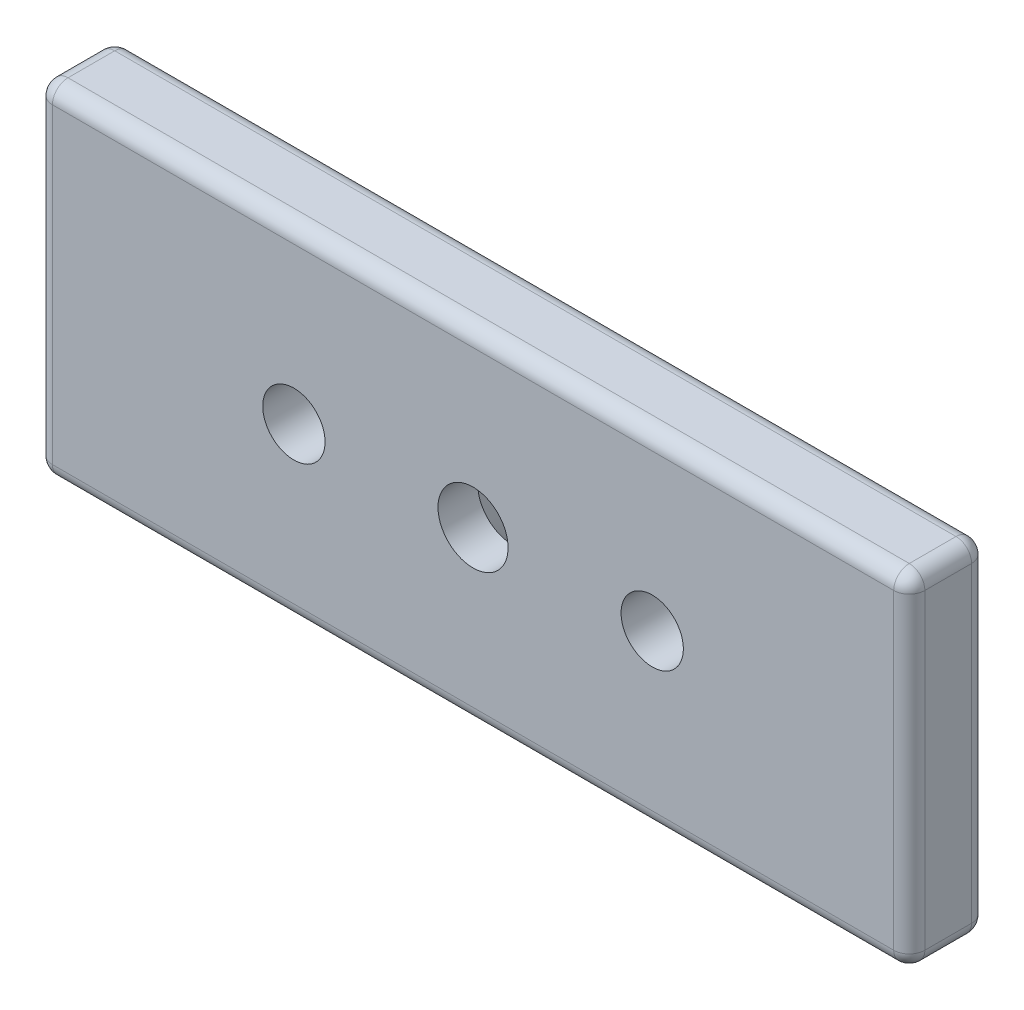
ISO-10303-21;
HEADER;
FILE_DESCRIPTION(('STEP AP214'),'2;1');
FILE_NAME('part.step','',(''),(''),'','','');
FILE_SCHEMA(('AUTOMOTIVE_DESIGN { 1 0 10303 214 1 1 1 1 }'));
ENDSEC;
DATA;
#1=APPLICATION_CONTEXT('core data for automotive mechanical design processes');
#2=APPLICATION_PROTOCOL_DEFINITION('international standard','automotive_design',2000,#1);
#3=PRODUCT_CONTEXT('',#1,'mechanical');
#4=PRODUCT('Part','Part','',(#3));
#5=PRODUCT_RELATED_PRODUCT_CATEGORY('part','',(#4));
#6=PRODUCT_DEFINITION_FORMATION('','',#4);
#7=PRODUCT_DEFINITION_CONTEXT('part definition',#1,'design');
#8=PRODUCT_DEFINITION('design','',#6,#7);
#9=PRODUCT_DEFINITION_SHAPE('','',#8);
#10=(LENGTH_UNIT() NAMED_UNIT(*) SI_UNIT(.MILLI.,.METRE.));
#11=(NAMED_UNIT(*) PLANE_ANGLE_UNIT() SI_UNIT($,.RADIAN.));
#12=(NAMED_UNIT(*) SI_UNIT($,.STERADIAN.) SOLID_ANGLE_UNIT());
#13=UNCERTAINTY_MEASURE_WITH_UNIT(LENGTH_MEASURE(1.E-05),#10,'distance_accuracy_value','');
#14=(GEOMETRIC_REPRESENTATION_CONTEXT(3) GLOBAL_UNCERTAINTY_ASSIGNED_CONTEXT((#13)) GLOBAL_UNIT_ASSIGNED_CONTEXT((#10,
#11,#12)) REPRESENTATION_CONTEXT('',''));
#15=CARTESIAN_POINT('',(0.,0.,0.));
#16=DIRECTION('',(0.,0.,1.));
#17=DIRECTION('',(1.,0.,0.));
#18=AXIS2_PLACEMENT_3D('',#15,#16,#17);
#19=CARTESIAN_POINT('',(0.,0.,-5.));
#20=DIRECTION('',(-1.,0.,0.));
#21=DIRECTION('',(0.,0.,1.));
#22=AXIS2_PLACEMENT_3D('',#19,#20,#21);
#23=PLANE('',#22);
#24=DIRECTION('',(0.,0.,1.));
#25=VECTOR('',#24,1.);
#26=CARTESIAN_POINT('',(0.,21.,-5.));
#27=LINE('',#26,#25);
#28=CARTESIAN_POINT('',(0.,21.,-1.));
#29=VERTEX_POINT('',#28);
#30=CARTESIAN_POINT('',(0.,21.,-4.));
#31=VERTEX_POINT('',#30);
#32=EDGE_CURVE('E158',#29,#31,#27,.F.);
#33=ORIENTED_EDGE('',*,*,#32,.T.);
#34=DIRECTION('',(0.,-1.,0.));
#35=VECTOR('',#34,1.);
#36=CARTESIAN_POINT('',(0.,0.,-4.));
#37=LINE('',#36,#35);
#38=CARTESIAN_POINT('',(0.,1.,-4.));
#39=VERTEX_POINT('',#38);
#40=EDGE_CURVE('E279',#31,#39,#37,.T.);
#41=ORIENTED_EDGE('',*,*,#40,.T.);
#42=DIRECTION('',(0.,0.,1.));
#43=VECTOR('',#42,1.);
#44=CARTESIAN_POINT('',(0.,1.,-5.));
#45=LINE('',#44,#43);
#46=CARTESIAN_POINT('',(0.,1.,-1.));
#47=VERTEX_POINT('',#46);
#48=EDGE_CURVE('E150',#39,#47,#45,.T.);
#49=ORIENTED_EDGE('',*,*,#48,.T.);
#50=DIRECTION('',(0.,-1.,0.));
#51=VECTOR('',#50,1.);
#52=CARTESIAN_POINT('',(0.,21.,-1.));
#53=LINE('',#52,#51);
#54=EDGE_CURVE('E277',#47,#29,#53,.F.);
#55=ORIENTED_EDGE('',*,*,#54,.T.);
#56=EDGE_LOOP('',(#33,#41,#49,#55));
#57=FACE_BOUND('',#56,.T.);
#58=ADVANCED_FACE('F38',(#57),#23,.T.);
#59=CARTESIAN_POINT('',(0.,22.,-5.));
#60=DIRECTION('',(0.,1.,0.));
#61=DIRECTION('',(0.,0.,1.));
#62=AXIS2_PLACEMENT_3D('',#59,#60,#61);
#63=PLANE('',#62);
#64=DIRECTION('',(0.,0.,1.));
#65=VECTOR('',#64,1.);
#66=CARTESIAN_POINT('',(55.,22.,-5.));
#67=LINE('',#66,#65);
#68=CARTESIAN_POINT('',(55.,22.,-1.));
#69=VERTEX_POINT('',#68);
#70=CARTESIAN_POINT('',(55.,22.,-4.));
#71=VERTEX_POINT('',#70);
#72=EDGE_CURVE('E131',#69,#71,#67,.F.);
#73=ORIENTED_EDGE('',*,*,#72,.T.);
#74=DIRECTION('',(-1.,0.,0.));
#75=VECTOR('',#74,1.);
#76=CARTESIAN_POINT('',(0.,22.,-4.));
#77=LINE('',#76,#75);
#78=CARTESIAN_POINT('',(1.,22.,-4.));
#79=VERTEX_POINT('',#78);
#80=EDGE_CURVE('E11',#71,#79,#77,.T.);
#81=ORIENTED_EDGE('',*,*,#80,.T.);
#82=DIRECTION('',(0.,0.,1.));
#83=VECTOR('',#82,1.);
#84=CARTESIAN_POINT('',(1.,22.,-5.));
#85=LINE('',#84,#83);
#86=CARTESIAN_POINT('',(1.,22.,-1.));
#87=VERTEX_POINT('',#86);
#88=EDGE_CURVE('E133',#79,#87,#85,.T.);
#89=ORIENTED_EDGE('',*,*,#88,.T.);
#90=DIRECTION('',(-1.,0.,0.));
#91=VECTOR('',#90,1.);
#92=CARTESIAN_POINT('',(55.,22.,-1.));
#93=LINE('',#92,#91);
#94=EDGE_CURVE('E47',#87,#69,#93,.F.);
#95=ORIENTED_EDGE('',*,*,#94,.T.);
#96=EDGE_LOOP('',(#73,#81,#89,#95));
#97=FACE_BOUND('',#96,.T.);
#98=ADVANCED_FACE('F130',(#97),#63,.T.);
#99=CARTESIAN_POINT('',(56.,0.,-5.));
#100=DIRECTION('',(1.,0.,0.));
#101=DIRECTION('',(0.,0.,-1.));
#102=AXIS2_PLACEMENT_3D('',#99,#100,#101);
#103=PLANE('',#102);
#104=DIRECTION('',(0.,0.,1.));
#105=VECTOR('',#104,1.);
#106=CARTESIAN_POINT('',(56.,1.,-5.));
#107=LINE('',#106,#105);
#108=CARTESIAN_POINT('',(56.,1.,-1.));
#109=VERTEX_POINT('',#108);
#110=CARTESIAN_POINT('',(56.,1.,-4.));
#111=VERTEX_POINT('',#110);
#112=EDGE_CURVE('E243',#109,#111,#107,.F.);
#113=ORIENTED_EDGE('',*,*,#112,.T.);
#114=DIRECTION('',(0.,1.,0.));
#115=VECTOR('',#114,1.);
#116=CARTESIAN_POINT('',(56.,0.,-4.));
#117=LINE('',#116,#115);
#118=CARTESIAN_POINT('',(56.,21.,-4.));
#119=VERTEX_POINT('',#118);
#120=EDGE_CURVE('E254',#111,#119,#117,.T.);
#121=ORIENTED_EDGE('',*,*,#120,.T.);
#122=DIRECTION('',(0.,0.,1.));
#123=VECTOR('',#122,1.);
#124=CARTESIAN_POINT('',(56.,21.,-5.));
#125=LINE('',#124,#123);
#126=CARTESIAN_POINT('',(56.,21.,-1.));
#127=VERTEX_POINT('',#126);
#128=EDGE_CURVE('E241',#119,#127,#125,.T.);
#129=ORIENTED_EDGE('',*,*,#128,.T.);
#130=DIRECTION('',(0.,1.,0.));
#131=VECTOR('',#130,1.);
#132=CARTESIAN_POINT('',(56.,1.,-1.));
#133=LINE('',#132,#131);
#134=EDGE_CURVE('E252',#127,#109,#133,.F.);
#135=ORIENTED_EDGE('',*,*,#134,.T.);
#136=EDGE_LOOP('',(#113,#121,#129,#135));
#137=FACE_BOUND('',#136,.T.);
#138=ADVANCED_FACE('F296',(#137),#103,.T.);
#139=CARTESIAN_POINT('',(0.,0.,-5.));
#140=DIRECTION('',(0.,-1.,0.));
#141=DIRECTION('',(0.,0.,-1.));
#142=AXIS2_PLACEMENT_3D('',#139,#140,#141);
#143=PLANE('',#142);
#144=DIRECTION('',(0.,0.,1.));
#145=VECTOR('',#144,1.);
#146=CARTESIAN_POINT('',(1.,0.,-5.));
#147=LINE('',#146,#145);
#148=CARTESIAN_POINT('',(1.,0.,-1.));
#149=VERTEX_POINT('',#148);
#150=CARTESIAN_POINT('',(1.,0.,-4.));
#151=VERTEX_POINT('',#150);
#152=EDGE_CURVE('E233',#149,#151,#147,.F.);
#153=ORIENTED_EDGE('',*,*,#152,.T.);
#154=DIRECTION('',(1.,0.,0.));
#155=VECTOR('',#154,1.);
#156=CARTESIAN_POINT('',(0.,0.,-4.));
#157=LINE('',#156,#155);
#158=CARTESIAN_POINT('',(55.,0.,-4.));
#159=VERTEX_POINT('',#158);
#160=EDGE_CURVE('E271',#151,#159,#157,.T.);
#161=ORIENTED_EDGE('',*,*,#160,.T.);
#162=DIRECTION('',(0.,0.,1.));
#163=VECTOR('',#162,1.);
#164=CARTESIAN_POINT('',(55.,0.,-5.));
#165=LINE('',#164,#163);
#166=CARTESIAN_POINT('',(55.,0.,-1.));
#167=VERTEX_POINT('',#166);
#168=EDGE_CURVE('E238',#159,#167,#165,.T.);
#169=ORIENTED_EDGE('',*,*,#168,.T.);
#170=DIRECTION('',(1.,0.,0.));
#171=VECTOR('',#170,1.);
#172=CARTESIAN_POINT('',(1.,0.,-1.));
#173=LINE('',#172,#171);
#174=EDGE_CURVE('E269',#167,#149,#173,.F.);
#175=ORIENTED_EDGE('',*,*,#174,.T.);
#176=EDGE_LOOP('',(#153,#161,#169,#175));
#177=FACE_BOUND('',#176,.T.);
#178=ADVANCED_FACE('F308',(#177),#143,.T.);
#179=CARTESIAN_POINT('',(0.,22.,-5.));
#180=DIRECTION('',(0.,0.,-1.));
#181=DIRECTION('',(-1.,0.,0.));
#182=AXIS2_PLACEMENT_3D('',#179,#180,#181);
#183=PLANE('',#182);
#184=CARTESIAN_POINT('',(28.,11.,-5.));
#185=DIRECTION('',(0.,0.,-1.));
#186=DIRECTION('',(-1.,0.,0.));
#187=AXIS2_PLACEMENT_3D('',#184,#185,#186);
#188=CIRCLE('',#187,4.7);
#189=CARTESIAN_POINT('',(23.3,11.,-5.));
#190=VERTEX_POINT('',#189);
#191=EDGE_CURVE('E615',#190,#190,#188,.T.);
#192=ORIENTED_EDGE('',*,*,#191,.F.);
#193=EDGE_LOOP('',(#192));
#194=FACE_BOUND('',#193,.T.);
#195=DIRECTION('',(-1.,0.,0.));
#196=VECTOR('',#195,1.);
#197=CARTESIAN_POINT('',(0.,21.,-5.));
#198=LINE('',#197,#196);
#199=CARTESIAN_POINT('',(1.,21.,-5.));
#200=VERTEX_POINT('',#199);
#201=CARTESIAN_POINT('',(55.,21.,-5.));
#202=VERTEX_POINT('',#201);
#203=EDGE_CURVE('E256',#200,#202,#198,.F.);
#204=ORIENTED_EDGE('',*,*,#203,.T.);
#205=DIRECTION('',(0.,1.,0.));
#206=VECTOR('',#205,1.);
#207=CARTESIAN_POINT('',(55.,22.,-5.));
#208=LINE('',#207,#206);
#209=CARTESIAN_POINT('',(55.,1.,-5.));
#210=VERTEX_POINT('',#209);
#211=EDGE_CURVE('E262',#202,#210,#208,.F.);
#212=ORIENTED_EDGE('',*,*,#211,.T.);
#213=DIRECTION('',(1.,0.,0.));
#214=VECTOR('',#213,1.);
#215=CARTESIAN_POINT('',(0.,1.,-5.));
#216=LINE('',#215,#214);
#217=CARTESIAN_POINT('',(1.,1.,-5.));
#218=VERTEX_POINT('',#217);
#219=EDGE_CURVE('E260',#210,#218,#216,.F.);
#220=ORIENTED_EDGE('',*,*,#219,.T.);
#221=DIRECTION('',(0.,-1.,0.));
#222=VECTOR('',#221,1.);
#223=CARTESIAN_POINT('',(1.,22.,-5.));
#224=LINE('',#223,#222);
#225=EDGE_CURVE('E258',#218,#200,#224,.F.);
#226=ORIENTED_EDGE('',*,*,#225,.T.);
#227=EDGE_LOOP('',(#204,#212,#220,#226));
#228=FACE_BOUND('',#227,.T.);
#229=CARTESIAN_POINT('',(39.5,11.,-5.));
#230=DIRECTION('',(0.,0.,1.));
#231=DIRECTION('',(1.,0.,0.));
#232=AXIS2_PLACEMENT_3D('',#229,#230,#231);
#233=CIRCLE('',#232,2.);
#234=CARTESIAN_POINT('',(41.5,11.,-5.));
#235=VERTEX_POINT('',#234);
#236=EDGE_CURVE('E222',#235,#235,#233,.T.);
#237=ORIENTED_EDGE('',*,*,#236,.T.);
#238=EDGE_LOOP('',(#237));
#239=FACE_BOUND('',#238,.T.);
#240=CARTESIAN_POINT('',(16.5,11.,-5.));
#241=DIRECTION('',(0.,0.,1.));
#242=DIRECTION('',(1.,0.,0.));
#243=AXIS2_PLACEMENT_3D('',#240,#241,#242);
#244=CIRCLE('',#243,2.);
#245=CARTESIAN_POINT('',(18.5,11.,-5.));
#246=VERTEX_POINT('',#245);
#247=EDGE_CURVE('E230',#246,#246,#244,.T.);
#248=ORIENTED_EDGE('',*,*,#247,.T.);
#249=EDGE_LOOP('',(#248));
#250=FACE_BOUND('',#249,.T.);
#251=ADVANCED_FACE('F334',(#194,#228,#239,#250),#183,.T.);
#252=CARTESIAN_POINT('',(0.,22.,0.));
#253=DIRECTION('',(0.,0.,-1.));
#254=DIRECTION('',(-1.,0.,0.));
#255=AXIS2_PLACEMENT_3D('',#252,#253,#254);
#256=PLANE('',#255);
#257=CARTESIAN_POINT('',(28.,11.,0.));
#258=DIRECTION('',(0.,0.,-1.));
#259=DIRECTION('',(-1.,0.,0.));
#260=AXIS2_PLACEMENT_3D('',#257,#258,#259);
#261=CIRCLE('',#260,2.25);
#262=CARTESIAN_POINT('',(25.75,11.,0.));
#263=VERTEX_POINT('',#262);
#264=EDGE_CURVE('E163',#263,#263,#261,.T.);
#265=ORIENTED_EDGE('',*,*,#264,.T.);
#266=EDGE_LOOP('',(#265));
#267=FACE_BOUND('',#266,.T.);
#268=DIRECTION('',(1.,0.,0.));
#269=VECTOR('',#268,1.);
#270=CARTESIAN_POINT('',(55.,1.,0.));
#271=LINE('',#270,#269);
#272=CARTESIAN_POINT('',(1.,1.,0.));
#273=VERTEX_POINT('',#272);
#274=CARTESIAN_POINT('',(55.,1.,0.));
#275=VERTEX_POINT('',#274);
#276=EDGE_CURVE('E55',#273,#275,#271,.T.);
#277=ORIENTED_EDGE('',*,*,#276,.T.);
#278=DIRECTION('',(0.,1.,0.));
#279=VECTOR('',#278,1.);
#280=CARTESIAN_POINT('',(55.,21.,0.));
#281=LINE('',#280,#279);
#282=CARTESIAN_POINT('',(55.,21.,0.));
#283=VERTEX_POINT('',#282);
#284=EDGE_CURVE('E138',#275,#283,#281,.T.);
#285=ORIENTED_EDGE('',*,*,#284,.T.);
#286=DIRECTION('',(-1.,0.,0.));
#287=VECTOR('',#286,1.);
#288=CARTESIAN_POINT('',(1.,21.,0.));
#289=LINE('',#288,#287);
#290=CARTESIAN_POINT('',(1.,21.,0.));
#291=VERTEX_POINT('',#290);
#292=EDGE_CURVE('E162',#283,#291,#289,.T.);
#293=ORIENTED_EDGE('',*,*,#292,.T.);
#294=DIRECTION('',(0.,-1.,0.));
#295=VECTOR('',#294,1.);
#296=CARTESIAN_POINT('',(1.,1.,0.));
#297=LINE('',#296,#295);
#298=EDGE_CURVE('E60',#291,#273,#297,.T.);
#299=ORIENTED_EDGE('',*,*,#298,.T.);
#300=EDGE_LOOP('',(#277,#285,#293,#299));
#301=FACE_BOUND('',#300,.T.);
#302=CARTESIAN_POINT('',(39.5,11.,0.));
#303=DIRECTION('',(0.,0.,1.));
#304=DIRECTION('',(1.,0.,0.));
#305=AXIS2_PLACEMENT_3D('',#302,#303,#304);
#306=CIRCLE('',#305,2.);
#307=CARTESIAN_POINT('',(41.5,11.,0.));
#308=VERTEX_POINT('',#307);
#309=EDGE_CURVE('E217',#308,#308,#306,.T.);
#310=ORIENTED_EDGE('',*,*,#309,.F.);
#311=EDGE_LOOP('',(#310));
#312=FACE_BOUND('',#311,.T.);
#313=CARTESIAN_POINT('',(16.5,11.,0.));
#314=DIRECTION('',(0.,0.,1.));
#315=DIRECTION('',(1.,0.,0.));
#316=AXIS2_PLACEMENT_3D('',#313,#314,#315);
#317=CIRCLE('',#316,2.);
#318=CARTESIAN_POINT('',(18.5,11.,0.));
#319=VERTEX_POINT('',#318);
#320=EDGE_CURVE('E227',#319,#319,#317,.T.);
#321=ORIENTED_EDGE('',*,*,#320,.F.);
#322=EDGE_LOOP('',(#321));
#323=FACE_BOUND('',#322,.T.);
#324=ADVANCED_FACE('F289',(#267,#301,#312,#323),#256,.F.);
#325=CARTESIAN_POINT('',(16.5,11.,-5.));
#326=DIRECTION('',(0.,0.,1.));
#327=DIRECTION('',(1.,0.,0.));
#328=AXIS2_PLACEMENT_3D('',#325,#326,#327);
#329=CYLINDRICAL_SURFACE('',#328,2.);
#330=ORIENTED_EDGE('',*,*,#247,.F.);
#331=EDGE_LOOP('',(#330));
#332=FACE_BOUND('',#331,.T.);
#333=ORIENTED_EDGE('',*,*,#320,.T.);
#334=EDGE_LOOP('',(#333));
#335=FACE_BOUND('',#334,.T.);
#336=ADVANCED_FACE('F555',(#332,#335),#329,.F.);
#337=CARTESIAN_POINT('',(39.5,11.,-5.));
#338=DIRECTION('',(0.,0.,1.));
#339=DIRECTION('',(1.,0.,0.));
#340=AXIS2_PLACEMENT_3D('',#337,#338,#339);
#341=CYLINDRICAL_SURFACE('',#340,2.);
#342=ORIENTED_EDGE('',*,*,#236,.F.);
#343=EDGE_LOOP('',(#342));
#344=FACE_BOUND('',#343,.T.);
#345=ORIENTED_EDGE('',*,*,#309,.T.);
#346=EDGE_LOOP('',(#345));
#347=FACE_BOUND('',#346,.T.);
#348=ADVANCED_FACE('F364',(#344,#347),#341,.F.);
#349=CARTESIAN_POINT('',(55.,1.,-5.));
#350=DIRECTION('',(0.,0.,1.));
#351=DIRECTION('',(1.,0.,0.));
#352=AXIS2_PLACEMENT_3D('',#349,#350,#351);
#353=CYLINDRICAL_SURFACE('',#352,1.);
#354=ORIENTED_EDGE('',*,*,#168,.F.);
#355=CARTESIAN_POINT('',(55.,1.,-4.));
#356=DIRECTION('',(0.,0.,1.));
#357=DIRECTION('',(1.,0.,0.));
#358=AXIS2_PLACEMENT_3D('',#355,#356,#357);
#359=CIRCLE('',#358,1.);
#360=EDGE_CURVE('E267',#159,#111,#359,.T.);
#361=ORIENTED_EDGE('',*,*,#360,.T.);
#362=ORIENTED_EDGE('',*,*,#112,.F.);
#363=CARTESIAN_POINT('',(55.,1.,-1.));
#364=DIRECTION('',(0.,0.,1.));
#365=DIRECTION('',(1.,0.,0.));
#366=AXIS2_PLACEMENT_3D('',#363,#364,#365);
#367=CIRCLE('',#366,1.);
#368=EDGE_CURVE('E265',#109,#167,#367,.F.);
#369=ORIENTED_EDGE('',*,*,#368,.T.);
#370=EDGE_LOOP('',(#354,#361,#362,#369));
#371=FACE_BOUND('',#370,.T.);
#372=ADVANCED_FACE('F301',(#371),#353,.T.);
#373=CARTESIAN_POINT('',(55.,21.,-5.));
#374=DIRECTION('',(0.,0.,1.));
#375=DIRECTION('',(1.,0.,0.));
#376=AXIS2_PLACEMENT_3D('',#373,#374,#375);
#377=CYLINDRICAL_SURFACE('',#376,1.);
#378=ORIENTED_EDGE('',*,*,#128,.F.);
#379=CARTESIAN_POINT('',(55.,21.,-4.));
#380=DIRECTION('',(0.,0.,1.));
#381=DIRECTION('',(1.,0.,0.));
#382=AXIS2_PLACEMENT_3D('',#379,#380,#381);
#383=CIRCLE('',#382,1.);
#384=EDGE_CURVE('E149',#119,#71,#383,.T.);
#385=ORIENTED_EDGE('',*,*,#384,.T.);
#386=ORIENTED_EDGE('',*,*,#72,.F.);
#387=CARTESIAN_POINT('',(55.,21.,-1.));
#388=DIRECTION('',(0.,0.,1.));
#389=DIRECTION('',(1.,0.,0.));
#390=AXIS2_PLACEMENT_3D('',#387,#388,#389);
#391=CIRCLE('',#390,1.);
#392=EDGE_CURVE('E146',#69,#127,#391,.F.);
#393=ORIENTED_EDGE('',*,*,#392,.T.);
#394=EDGE_LOOP('',(#378,#385,#386,#393));
#395=FACE_BOUND('',#394,.T.);
#396=ADVANCED_FACE('F145',(#395),#377,.T.);
#397=CARTESIAN_POINT('',(1.,21.,-5.));
#398=DIRECTION('',(0.,0.,1.));
#399=DIRECTION('',(1.,0.,0.));
#400=AXIS2_PLACEMENT_3D('',#397,#398,#399);
#401=CYLINDRICAL_SURFACE('',#400,1.);
#402=ORIENTED_EDGE('',*,*,#88,.F.);
#403=CARTESIAN_POINT('',(1.,21.,-4.));
#404=DIRECTION('',(0.,0.,1.));
#405=DIRECTION('',(1.,0.,0.));
#406=AXIS2_PLACEMENT_3D('',#403,#404,#405);
#407=CIRCLE('',#406,1.);
#408=EDGE_CURVE('E283',#79,#31,#407,.T.);
#409=ORIENTED_EDGE('',*,*,#408,.T.);
#410=ORIENTED_EDGE('',*,*,#32,.F.);
#411=CARTESIAN_POINT('',(1.,21.,-1.));
#412=DIRECTION('',(0.,0.,1.));
#413=DIRECTION('',(1.,0.,0.));
#414=AXIS2_PLACEMENT_3D('',#411,#412,#413);
#415=CIRCLE('',#414,1.);
#416=EDGE_CURVE('E281',#29,#87,#415,.F.);
#417=ORIENTED_EDGE('',*,*,#416,.T.);
#418=EDGE_LOOP('',(#402,#409,#410,#417));
#419=FACE_BOUND('',#418,.T.);
#420=ADVANCED_FACE('F321',(#419),#401,.T.);
#421=CARTESIAN_POINT('',(1.,1.,-5.));
#422=DIRECTION('',(0.,0.,1.));
#423=DIRECTION('',(1.,0.,0.));
#424=AXIS2_PLACEMENT_3D('',#421,#422,#423);
#425=CYLINDRICAL_SURFACE('',#424,1.);
#426=ORIENTED_EDGE('',*,*,#48,.F.);
#427=CARTESIAN_POINT('',(1.,1.,-4.));
#428=DIRECTION('',(0.,0.,1.));
#429=DIRECTION('',(1.,0.,0.));
#430=AXIS2_PLACEMENT_3D('',#427,#428,#429);
#431=CIRCLE('',#430,1.);
#432=EDGE_CURVE('E275',#39,#151,#431,.T.);
#433=ORIENTED_EDGE('',*,*,#432,.T.);
#434=ORIENTED_EDGE('',*,*,#152,.F.);
#435=CARTESIAN_POINT('',(1.,1.,-1.));
#436=DIRECTION('',(0.,0.,1.));
#437=DIRECTION('',(1.,0.,0.));
#438=AXIS2_PLACEMENT_3D('',#435,#436,#437);
#439=CIRCLE('',#438,1.);
#440=EDGE_CURVE('E273',#149,#47,#439,.F.);
#441=ORIENTED_EDGE('',*,*,#440,.T.);
#442=EDGE_LOOP('',(#426,#433,#434,#441));
#443=FACE_BOUND('',#442,.T.);
#444=ADVANCED_FACE('F312',(#443),#425,.T.);
#445=CARTESIAN_POINT('',(1.,1.,-4.));
#446=DIRECTION('',(0.,0.,1.));
#447=DIRECTION('',(1.,0.,0.));
#448=AXIS2_PLACEMENT_3D('',#445,#446,#447);
#449=SPHERICAL_SURFACE('',#448,1.);
#450=CARTESIAN_POINT('',(1.,1.,-4.));
#451=DIRECTION('',(1.,0.,0.));
#452=DIRECTION('',(0.,0.,-1.));
#453=AXIS2_PLACEMENT_3D('',#450,#451,#452);
#454=CIRCLE('',#453,1.);
#455=EDGE_CURVE('E209',#151,#218,#454,.T.);
#456=ORIENTED_EDGE('',*,*,#455,.F.);
#457=ORIENTED_EDGE('',*,*,#432,.F.);
#458=CARTESIAN_POINT('',(1.,1.,-4.));
#459=DIRECTION('',(0.,1.,0.));
#460=DIRECTION('',(0.,0.,1.));
#461=AXIS2_PLACEMENT_3D('',#458,#459,#460);
#462=CIRCLE('',#461,1.);
#463=EDGE_CURVE('E171',#218,#39,#462,.T.);
#464=ORIENTED_EDGE('',*,*,#463,.F.);
#465=EDGE_LOOP('',(#456,#457,#464));
#466=FACE_BOUND('',#465,.T.);
#467=ADVANCED_FACE('F351',(#466),#449,.T.);
#468=CARTESIAN_POINT('',(1.,0.,-4.));
#469=DIRECTION('',(0.,-1.,0.));
#470=DIRECTION('',(0.,0.,-1.));
#471=AXIS2_PLACEMENT_3D('',#468,#469,#470);
#472=CYLINDRICAL_SURFACE('',#471,1.);
#473=ORIENTED_EDGE('',*,*,#463,.T.);
#474=ORIENTED_EDGE('',*,*,#40,.F.);
#475=CARTESIAN_POINT('',(1.,21.,-4.));
#476=DIRECTION('',(0.,1.,0.));
#477=DIRECTION('',(0.,0.,1.));
#478=AXIS2_PLACEMENT_3D('',#475,#476,#477);
#479=CIRCLE('',#478,1.);
#480=EDGE_CURVE('E207',#200,#31,#479,.T.);
#481=ORIENTED_EDGE('',*,*,#480,.F.);
#482=ORIENTED_EDGE('',*,*,#225,.F.);
#483=EDGE_LOOP('',(#473,#474,#481,#482));
#484=FACE_BOUND('',#483,.T.);
#485=ADVANCED_FACE('F344',(#484),#472,.T.);
#486=CARTESIAN_POINT('',(0.,1.,-4.));
#487=DIRECTION('',(1.,0.,0.));
#488=DIRECTION('',(0.,0.,-1.));
#489=AXIS2_PLACEMENT_3D('',#486,#487,#488);
#490=CYLINDRICAL_SURFACE('',#489,1.);
#491=ORIENTED_EDGE('',*,*,#455,.T.);
#492=ORIENTED_EDGE('',*,*,#219,.F.);
#493=CARTESIAN_POINT('',(55.,1.,-4.));
#494=DIRECTION('',(1.,0.,0.));
#495=DIRECTION('',(0.,0.,-1.));
#496=AXIS2_PLACEMENT_3D('',#493,#494,#495);
#497=CIRCLE('',#496,1.);
#498=EDGE_CURVE('E204',#159,#210,#497,.T.);
#499=ORIENTED_EDGE('',*,*,#498,.F.);
#500=ORIENTED_EDGE('',*,*,#160,.F.);
#501=EDGE_LOOP('',(#491,#492,#499,#500));
#502=FACE_BOUND('',#501,.T.);
#503=ADVANCED_FACE('F342',(#502),#490,.T.);
#504=CARTESIAN_POINT('',(1.,21.,-4.));
#505=DIRECTION('',(0.,0.,1.));
#506=DIRECTION('',(1.,0.,0.));
#507=AXIS2_PLACEMENT_3D('',#504,#505,#506);
#508=SPHERICAL_SURFACE('',#507,1.);
#509=ORIENTED_EDGE('',*,*,#480,.T.);
#510=ORIENTED_EDGE('',*,*,#408,.F.);
#511=CARTESIAN_POINT('',(1.,21.,-4.));
#512=DIRECTION('',(1.,0.,0.));
#513=DIRECTION('',(0.,0.,-1.));
#514=AXIS2_PLACEMENT_3D('',#511,#512,#513);
#515=CIRCLE('',#514,1.);
#516=EDGE_CURVE('E201',#200,#79,#515,.T.);
#517=ORIENTED_EDGE('',*,*,#516,.F.);
#518=EDGE_LOOP('',(#509,#510,#517));
#519=FACE_BOUND('',#518,.T.);
#520=ADVANCED_FACE('F325',(#519),#508,.T.);
#521=CARTESIAN_POINT('',(55.,1.,-4.));
#522=DIRECTION('',(0.,0.,1.));
#523=DIRECTION('',(1.,0.,0.));
#524=AXIS2_PLACEMENT_3D('',#521,#522,#523);
#525=SPHERICAL_SURFACE('',#524,1.);
#526=ORIENTED_EDGE('',*,*,#360,.F.);
#527=ORIENTED_EDGE('',*,*,#498,.T.);
#528=CARTESIAN_POINT('',(55.,1.,-4.));
#529=DIRECTION('',(0.,1.,0.));
#530=DIRECTION('',(0.,0.,1.));
#531=AXIS2_PLACEMENT_3D('',#528,#529,#530);
#532=CIRCLE('',#531,1.);
#533=EDGE_CURVE('E197',#111,#210,#532,.T.);
#534=ORIENTED_EDGE('',*,*,#533,.F.);
#535=EDGE_LOOP('',(#526,#527,#534));
#536=FACE_BOUND('',#535,.T.);
#537=ADVANCED_FACE('F341',(#536),#525,.T.);
#538=CARTESIAN_POINT('',(0.,21.,-4.));
#539=DIRECTION('',(-1.,0.,0.));
#540=DIRECTION('',(0.,0.,1.));
#541=AXIS2_PLACEMENT_3D('',#538,#539,#540);
#542=CYLINDRICAL_SURFACE('',#541,1.);
#543=ORIENTED_EDGE('',*,*,#516,.T.);
#544=ORIENTED_EDGE('',*,*,#80,.F.);
#545=CARTESIAN_POINT('',(55.,21.,-4.));
#546=DIRECTION('',(1.,0.,0.));
#547=DIRECTION('',(0.,0.,-1.));
#548=AXIS2_PLACEMENT_3D('',#545,#546,#547);
#549=CIRCLE('',#548,1.);
#550=EDGE_CURVE('E193',#202,#71,#549,.T.);
#551=ORIENTED_EDGE('',*,*,#550,.F.);
#552=ORIENTED_EDGE('',*,*,#203,.F.);
#553=EDGE_LOOP('',(#543,#544,#551,#552));
#554=FACE_BOUND('',#553,.T.);
#555=ADVANCED_FACE('F330',(#554),#542,.T.);
#556=CARTESIAN_POINT('',(55.,0.,-4.));
#557=DIRECTION('',(0.,1.,0.));
#558=DIRECTION('',(0.,0.,1.));
#559=AXIS2_PLACEMENT_3D('',#556,#557,#558);
#560=CYLINDRICAL_SURFACE('',#559,1.);
#561=ORIENTED_EDGE('',*,*,#533,.T.);
#562=ORIENTED_EDGE('',*,*,#211,.F.);
#563=CARTESIAN_POINT('',(55.,21.,-4.));
#564=DIRECTION('',(0.,1.,0.));
#565=DIRECTION('',(0.,0.,1.));
#566=AXIS2_PLACEMENT_3D('',#563,#564,#565);
#567=CIRCLE('',#566,1.);
#568=EDGE_CURVE('E189',#119,#202,#567,.T.);
#569=ORIENTED_EDGE('',*,*,#568,.F.);
#570=ORIENTED_EDGE('',*,*,#120,.F.);
#571=EDGE_LOOP('',(#561,#562,#569,#570));
#572=FACE_BOUND('',#571,.T.);
#573=ADVANCED_FACE('F337',(#572),#560,.T.);
#574=CARTESIAN_POINT('',(55.,21.,-4.));
#575=DIRECTION('',(0.,0.,1.));
#576=DIRECTION('',(1.,0.,0.));
#577=AXIS2_PLACEMENT_3D('',#574,#575,#576);
#578=SPHERICAL_SURFACE('',#577,1.);
#579=ORIENTED_EDGE('',*,*,#550,.T.);
#580=ORIENTED_EDGE('',*,*,#384,.F.);
#581=ORIENTED_EDGE('',*,*,#568,.T.);
#582=EDGE_LOOP('',(#579,#580,#581));
#583=FACE_BOUND('',#582,.T.);
#584=ADVANCED_FACE('F371',(#583),#578,.T.);
#585=CARTESIAN_POINT('',(1.,1.,-1.));
#586=DIRECTION('',(0.,0.,1.));
#587=DIRECTION('',(1.,0.,0.));
#588=AXIS2_PLACEMENT_3D('',#585,#586,#587);
#589=SPHERICAL_SURFACE('',#588,1.);
#590=CARTESIAN_POINT('',(1.,1.,-1.));
#591=DIRECTION('',(0.,1.,0.));
#592=DIRECTION('',(0.,0.,1.));
#593=AXIS2_PLACEMENT_3D('',#590,#591,#592);
#594=CIRCLE('',#593,1.);
#595=EDGE_CURVE('E183',#47,#273,#594,.T.);
#596=ORIENTED_EDGE('',*,*,#595,.F.);
#597=ORIENTED_EDGE('',*,*,#440,.F.);
#598=CARTESIAN_POINT('',(1.,1.,-1.));
#599=DIRECTION('',(1.,0.,0.));
#600=DIRECTION('',(0.,0.,-1.));
#601=AXIS2_PLACEMENT_3D('',#598,#599,#600);
#602=CIRCLE('',#601,1.);
#603=EDGE_CURVE('E42',#273,#149,#602,.T.);
#604=ORIENTED_EDGE('',*,*,#603,.F.);
#605=EDGE_LOOP('',(#596,#597,#604));
#606=FACE_BOUND('',#605,.T.);
#607=ADVANCED_FACE('F40',(#606),#589,.T.);
#608=CARTESIAN_POINT('',(0.,1.,-1.));
#609=DIRECTION('',(-1.,0.,0.));
#610=DIRECTION('',(0.,0.,1.));
#611=AXIS2_PLACEMENT_3D('',#608,#609,#610);
#612=CYLINDRICAL_SURFACE('',#611,1.);
#613=ORIENTED_EDGE('',*,*,#603,.T.);
#614=ORIENTED_EDGE('',*,*,#174,.F.);
#615=CARTESIAN_POINT('',(55.,1.,-1.));
#616=DIRECTION('',(1.,0.,0.));
#617=DIRECTION('',(0.,0.,-1.));
#618=AXIS2_PLACEMENT_3D('',#615,#616,#617);
#619=CIRCLE('',#618,1.);
#620=EDGE_CURVE('E181',#275,#167,#619,.T.);
#621=ORIENTED_EDGE('',*,*,#620,.F.);
#622=ORIENTED_EDGE('',*,*,#276,.F.);
#623=EDGE_LOOP('',(#613,#614,#621,#622));
#624=FACE_BOUND('',#623,.T.);
#625=ADVANCED_FACE('F305',(#624),#612,.T.);
#626=CARTESIAN_POINT('',(1.,22.,-1.));
#627=DIRECTION('',(0.,1.,0.));
#628=DIRECTION('',(0.,0.,1.));
#629=AXIS2_PLACEMENT_3D('',#626,#627,#628);
#630=CYLINDRICAL_SURFACE('',#629,1.);
#631=ORIENTED_EDGE('',*,*,#595,.T.);
#632=ORIENTED_EDGE('',*,*,#298,.F.);
#633=CARTESIAN_POINT('',(1.,21.,-1.));
#634=DIRECTION('',(0.,1.,0.));
#635=DIRECTION('',(0.,0.,1.));
#636=AXIS2_PLACEMENT_3D('',#633,#634,#635);
#637=CIRCLE('',#636,1.);
#638=EDGE_CURVE('E178',#29,#291,#637,.T.);
#639=ORIENTED_EDGE('',*,*,#638,.F.);
#640=ORIENTED_EDGE('',*,*,#54,.F.);
#641=EDGE_LOOP('',(#631,#632,#639,#640));
#642=FACE_BOUND('',#641,.T.);
#643=ADVANCED_FACE('F316',(#642),#630,.T.);
#644=CARTESIAN_POINT('',(55.,1.,-1.));
#645=DIRECTION('',(0.,0.,1.));
#646=DIRECTION('',(1.,0.,0.));
#647=AXIS2_PLACEMENT_3D('',#644,#645,#646);
#648=SPHERICAL_SURFACE('',#647,1.);
#649=ORIENTED_EDGE('',*,*,#620,.T.);
#650=ORIENTED_EDGE('',*,*,#368,.F.);
#651=CARTESIAN_POINT('',(55.,1.,-1.));
#652=DIRECTION('',(0.,1.,0.));
#653=DIRECTION('',(0.,0.,1.));
#654=AXIS2_PLACEMENT_3D('',#651,#652,#653);
#655=CIRCLE('',#654,1.);
#656=EDGE_CURVE('E175',#275,#109,#655,.T.);
#657=ORIENTED_EDGE('',*,*,#656,.F.);
#658=EDGE_LOOP('',(#649,#650,#657));
#659=FACE_BOUND('',#658,.T.);
#660=ADVANCED_FACE('F304',(#659),#648,.T.);
#661=CARTESIAN_POINT('',(1.,21.,-1.));
#662=DIRECTION('',(0.,0.,1.));
#663=DIRECTION('',(1.,0.,0.));
#664=AXIS2_PLACEMENT_3D('',#661,#662,#663);
#665=SPHERICAL_SURFACE('',#664,1.);
#666=ORIENTED_EDGE('',*,*,#416,.F.);
#667=ORIENTED_EDGE('',*,*,#638,.T.);
#668=CARTESIAN_POINT('',(1.,21.,-1.));
#669=DIRECTION('',(1.,0.,0.));
#670=DIRECTION('',(0.,0.,-1.));
#671=AXIS2_PLACEMENT_3D('',#668,#669,#670);
#672=CIRCLE('',#671,1.);
#673=EDGE_CURVE('E165',#87,#291,#672,.T.);
#674=ORIENTED_EDGE('',*,*,#673,.F.);
#675=EDGE_LOOP('',(#666,#667,#674));
#676=FACE_BOUND('',#675,.T.);
#677=ADVANCED_FACE('F417',(#676),#665,.T.);
#678=CARTESIAN_POINT('',(55.,22.,-1.));
#679=DIRECTION('',(0.,-1.,0.));
#680=DIRECTION('',(0.,0.,-1.));
#681=AXIS2_PLACEMENT_3D('',#678,#679,#680);
#682=CYLINDRICAL_SURFACE('',#681,1.);
#683=ORIENTED_EDGE('',*,*,#656,.T.);
#684=ORIENTED_EDGE('',*,*,#134,.F.);
#685=CARTESIAN_POINT('',(55.,21.,-1.));
#686=DIRECTION('',(0.,1.,0.));
#687=DIRECTION('',(0.,0.,1.));
#688=AXIS2_PLACEMENT_3D('',#685,#686,#687);
#689=CIRCLE('',#688,1.);
#690=EDGE_CURVE('E156',#283,#127,#689,.T.);
#691=ORIENTED_EDGE('',*,*,#690,.F.);
#692=ORIENTED_EDGE('',*,*,#284,.F.);
#693=EDGE_LOOP('',(#683,#684,#691,#692));
#694=FACE_BOUND('',#693,.T.);
#695=ADVANCED_FACE('F292',(#694),#682,.T.);
#696=CARTESIAN_POINT('',(0.,21.,-1.));
#697=DIRECTION('',(1.,0.,0.));
#698=DIRECTION('',(0.,0.,-1.));
#699=AXIS2_PLACEMENT_3D('',#696,#697,#698);
#700=CYLINDRICAL_SURFACE('',#699,1.);
#701=ORIENTED_EDGE('',*,*,#673,.T.);
#702=ORIENTED_EDGE('',*,*,#292,.F.);
#703=CARTESIAN_POINT('',(55.,21.,-1.));
#704=DIRECTION('',(1.,0.,0.));
#705=DIRECTION('',(0.,0.,-1.));
#706=AXIS2_PLACEMENT_3D('',#703,#704,#705);
#707=CIRCLE('',#706,1.);
#708=EDGE_CURVE('E154',#69,#283,#707,.T.);
#709=ORIENTED_EDGE('',*,*,#708,.F.);
#710=ORIENTED_EDGE('',*,*,#94,.F.);
#711=EDGE_LOOP('',(#701,#702,#709,#710));
#712=FACE_BOUND('',#711,.T.);
#713=ADVANCED_FACE('F161',(#712),#700,.T.);
#714=CARTESIAN_POINT('',(55.,21.,-1.));
#715=DIRECTION('',(0.,0.,1.));
#716=DIRECTION('',(1.,0.,0.));
#717=AXIS2_PLACEMENT_3D('',#714,#715,#716);
#718=SPHERICAL_SURFACE('',#717,1.);
#719=ORIENTED_EDGE('',*,*,#690,.T.);
#720=ORIENTED_EDGE('',*,*,#392,.F.);
#721=ORIENTED_EDGE('',*,*,#708,.T.);
#722=EDGE_LOOP('',(#719,#720,#721));
#723=FACE_BOUND('',#722,.T.);
#724=ADVANCED_FACE('F153',(#723),#718,.T.);
#725=CARTESIAN_POINT('',(28.,11.,-5.));
#726=DIRECTION('',(0.,0.,-1.));
#727=DIRECTION('',(-1.,0.,0.));
#728=AXIS2_PLACEMENT_3D('',#725,#726,#727);
#729=CYLINDRICAL_SURFACE('',#728,2.25);
#730=ORIENTED_EDGE('',*,*,#264,.F.);
#731=EDGE_LOOP('',(#730));
#732=FACE_BOUND('',#731,.T.);
#733=CARTESIAN_POINT('',(28.,11.,-2.55));
#734=DIRECTION('',(0.,0.,-1.));
#735=DIRECTION('',(-1.,0.,0.));
#736=AXIS2_PLACEMENT_3D('',#733,#734,#735);
#737=CIRCLE('',#736,2.25);
#738=CARTESIAN_POINT('',(25.75,11.,-2.55));
#739=VERTEX_POINT('',#738);
#740=EDGE_CURVE('E168',#739,#739,#737,.T.);
#741=ORIENTED_EDGE('',*,*,#740,.T.);
#742=EDGE_LOOP('',(#741));
#743=FACE_BOUND('',#742,.T.);
#744=ADVANCED_FACE('F443',(#732,#743),#729,.F.);
#745=CARTESIAN_POINT('',(28.,11.,-5.));
#746=DIRECTION('',(0.,0.,-1.));
#747=DIRECTION('',(-1.,0.,0.));
#748=AXIS2_PLACEMENT_3D('',#745,#746,#747);
#749=CONICAL_SURFACE('',#748,4.7,0.785398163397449);
#750=ORIENTED_EDGE('',*,*,#740,.F.);
#751=EDGE_LOOP('',(#750));
#752=FACE_BOUND('',#751,.T.);
#753=ORIENTED_EDGE('',*,*,#191,.T.);
#754=EDGE_LOOP('',(#753));
#755=FACE_BOUND('',#754,.T.);
#756=ADVANCED_FACE('F451',(#752,#755),#749,.F.);
#757=CLOSED_SHELL('',(#58,#98,#138,#178,#251,#324,#336,#348,#372,#396,#420,#444,#467,#485,#503,
#520,#537,#555,#573,#584,#607,#625,#643,#660,#677,#695,#713,#724,#744,#756));
#758=MANIFOLD_SOLID_BREP('B2',#757);
#759=ADVANCED_BREP_SHAPE_REPRESENTATION('',(#18,#758),#14);
#760=SHAPE_DEFINITION_REPRESENTATION(#9,#759);
ENDSEC;
END-ISO-10303-21;
